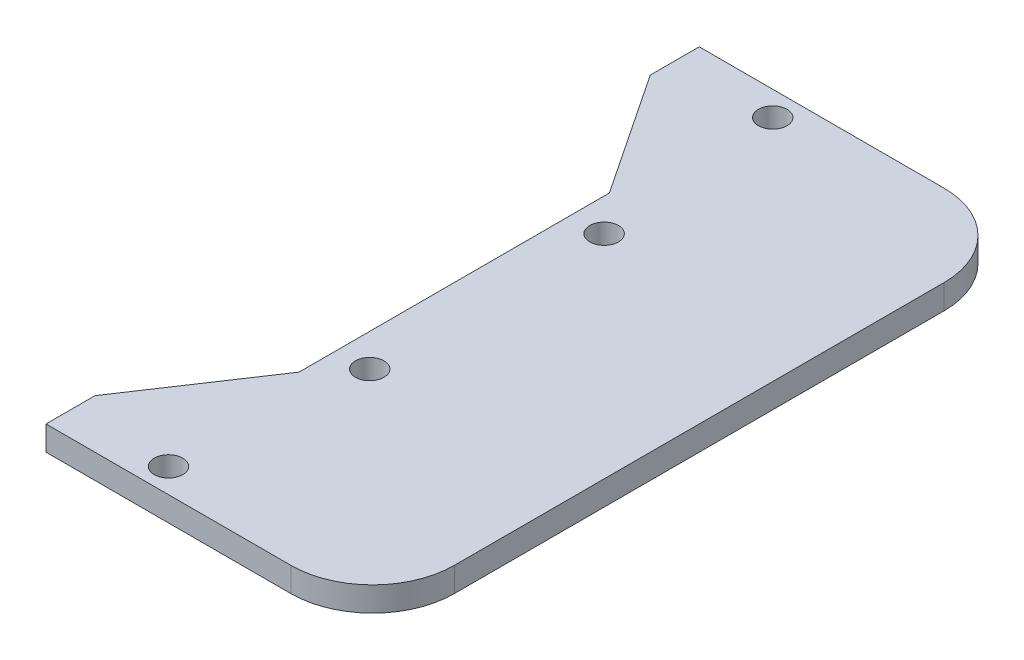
from build123d import *

# Parameters (mm, degrees)
SKETCH1_R           = 1.75
BOSS_EXTRUDE1_DEPTH = 3


with BuildPart() as part:
    # Sketch1 → Boss-Extrude1 (new body)
    with BuildSketch(Plane(origin=(0, 0, 0), x_dir=(1, 0, 0), z_dir=(0, 1, 0))):
        with BuildLine():
            Line((0, 19), (0, -19))
            Line((0, -19), (-10, -34))
            Line((-10, -34), (-10, -40))
            Line((-10, -40), (20, -40))
            ThreePointArc((20, -40), (27.071067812, -37.071067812), (30, -30))
            Line((30, -30), (30, 30))
            ThreePointArc((30, 30), (27.071067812, 37.071067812), (20, 40))
            Line((20, 40), (-10, 40))
            Line((-10, 40), (-10, 34))
            Line((-10, 34), (0, 19))
        make_face()
        with Locations(Location((2, 37, 0), (0, 0, 270))):
            Circle(SKETCH1_R, mode=Mode.SUBTRACT)
        with Locations(Location((4, 14.355, 0), (0, 0, 270))):
            Circle(SKETCH1_R, mode=Mode.SUBTRACT)
        with Locations(Location((2, -37, 0), (0, 0, 90))):
            Circle(SKETCH1_R, mode=Mode.SUBTRACT)
        with Locations(Location((4, -14.355, 0), (0, 0, 90))):
            Circle(SKETCH1_R, mode=Mode.SUBTRACT)
    extrude(amount=BOSS_EXTRUDE1_DEPTH)


solid = part.part
